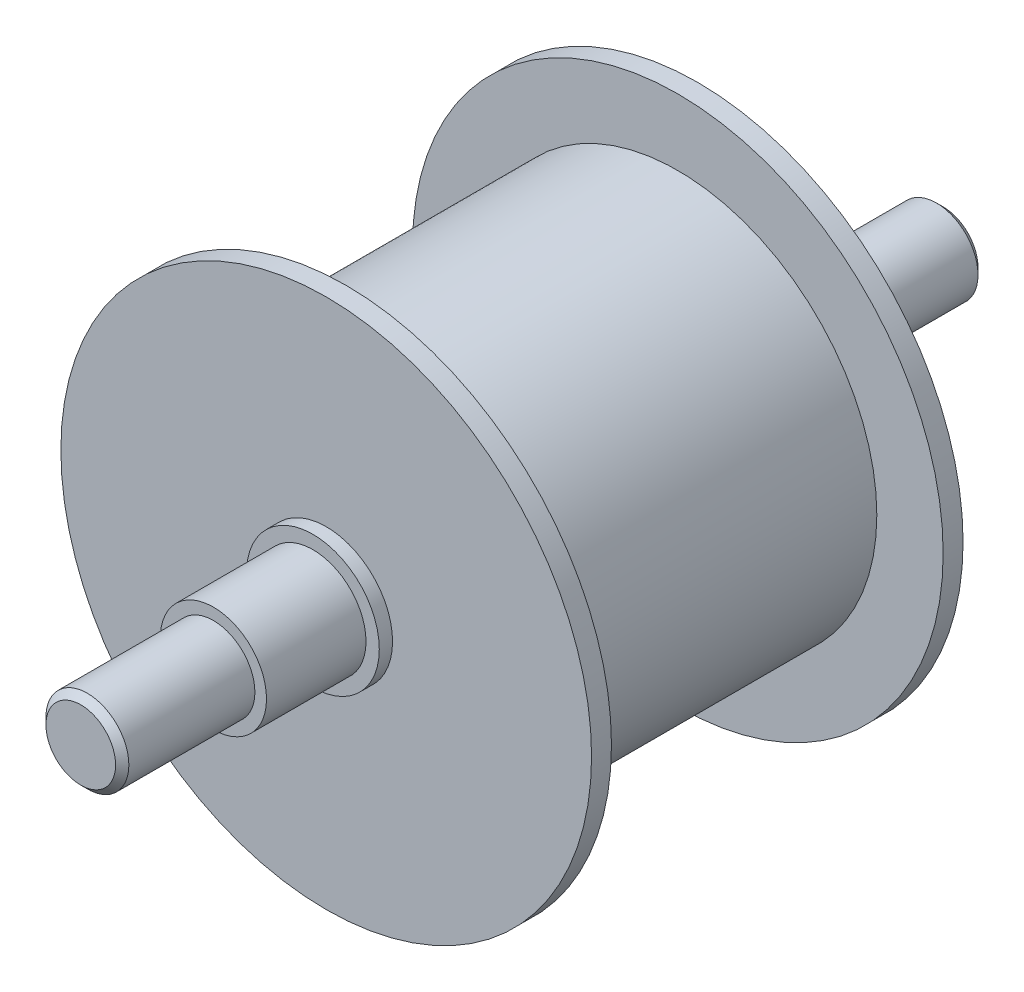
from build123d import *

# Parameters (mm, degrees)
SKIZZE1_R                        = 45
AUFSATZ_LINEAR_AUSTRAGEN1_DEPTH  = 130
SKIZZE2_OUTSIDE_W                = 128.386
SKIZZE2_OUTSIDE_H                = 128.386
SKIZZE2_OUTSIDE_R                = 6.25
SCHNITT_LINEAR_AUSTRAGEN3_DEPTH  = 20
SKIZZE4_OUTSIDE_W                = 128.386
SKIZZE4_OUTSIDE_H                = 128.386
SKIZZE4_OUTSIDE_R                = 8
SCHNITT_LINEAR_AUSTRAGEN4_DEPTH  = 15
SKIZZE5_OUTSIDE_W                = 128.386
SKIZZE5_OUTSIDE_H                = 128.386
SKIZZE5_OUTSIDE_R                = 10
SCHNITT_LINEAR_AUSTRAGEN5_DEPTH  = 2
SKIZZE6_OUTSIDE_W                = 128.386
SKIZZE6_OUTSIDE_H                = 128.386
SKIZZE6_OUTSIDE_R                = 40
SCHNITT_LINEAR_AUSTRAGEN6_DEPTH  = 3
SKIZZE7_OUTSIDE_W                = 128.386
SKIZZE7_OUTSIDE_H                = 128.386
SKIZZE7_OUTSIDE_R                = 30
SCHNITT_LINEAR_AUSTRAGEN7_DEPTH  = 50
SKIZZE8_OUTSIDE_W                = 128.386
SKIZZE8_OUTSIDE_H                = 128.386
SKIZZE8_OUTSIDE_R                = 40
SCHNITT_LINEAR_AUSTRAGEN8_DEPTH  = 3
SKIZZE9_OUTSIDE_W                = 128.386
SKIZZE9_OUTSIDE_H                = 128.386
SKIZZE9_OUTSIDE_R                = 10
SCHNITT_LINEAR_AUSTRAGEN9_DEPTH  = 2
SKIZZE10_OUTSIDE_W               = 128.386
SKIZZE10_OUTSIDE_H               = 128.386
SKIZZE10_OUTSIDE_R               = 8
SCHNITT_LINEAR_AUSTRAGEN10_DEPTH = 15
SKIZZE11_OUTSIDE_W               = 128.386
SKIZZE11_OUTSIDE_H               = 128.386
SKIZZE11_OUTSIDE_R               = 6.25
SCHNITT_LINEAR_AUSTRAGEN11_DEPTH = 20
FASE1_SIZE                       = 1
FASE2_SIZE                       = 1


with BuildPart() as part:
    # Skizze1 → Aufsatz-Linear austragen1 (new body)
    with BuildSketch(Plane.XY):
        Circle(SKIZZE1_R)
    extrude(amount=AUFSATZ_LINEAR_AUSTRAGEN1_DEPTH)

    # Skizze2 outside → Schnitt-Linear austragen3 (cut)
    with BuildSketch(Plane.XY.offset(130)):
        Rectangle(SKIZZE2_OUTSIDE_W, SKIZZE2_OUTSIDE_H)
        Circle(SKIZZE2_OUTSIDE_R, mode=Mode.SUBTRACT)
    extrude(amount=-SCHNITT_LINEAR_AUSTRAGEN3_DEPTH, mode=Mode.SUBTRACT)

    # Skizze4 outside → Schnitt-Linear austragen4 (cut)
    with BuildSketch(Plane.XY.offset(110)):
        Rectangle(SKIZZE4_OUTSIDE_W, SKIZZE4_OUTSIDE_H)
        Circle(SKIZZE4_OUTSIDE_R, mode=Mode.SUBTRACT)
    extrude(amount=-SCHNITT_LINEAR_AUSTRAGEN4_DEPTH, mode=Mode.SUBTRACT)

    # Skizze5 outside → Schnitt-Linear austragen5 (cut)
    with BuildSketch(Plane.XY.offset(95)):
        Rectangle(SKIZZE5_OUTSIDE_W, SKIZZE5_OUTSIDE_H)
        Circle(SKIZZE5_OUTSIDE_R, mode=Mode.SUBTRACT)
    extrude(amount=-SCHNITT_LINEAR_AUSTRAGEN5_DEPTH, mode=Mode.SUBTRACT)

    # Skizze6 outside → Schnitt-Linear austragen6 (cut)
    with BuildSketch(Plane.XY.offset(93)):
        Rectangle(SKIZZE6_OUTSIDE_W, SKIZZE6_OUTSIDE_H)
        Circle(SKIZZE6_OUTSIDE_R, mode=Mode.SUBTRACT)
    extrude(amount=-SCHNITT_LINEAR_AUSTRAGEN6_DEPTH, mode=Mode.SUBTRACT)

    # Skizze7 outside → Schnitt-Linear austragen7 (cut)
    with BuildSketch(Plane.XY.offset(90)):
        Rectangle(SKIZZE7_OUTSIDE_W, SKIZZE7_OUTSIDE_H)
        Circle(SKIZZE7_OUTSIDE_R, mode=Mode.SUBTRACT)
    extrude(amount=-SCHNITT_LINEAR_AUSTRAGEN7_DEPTH, mode=Mode.SUBTRACT)

    # Skizze8 outside → Schnitt-Linear austragen8 (cut)
    with BuildSketch(Plane.XY.offset(40)):
        Rectangle(SKIZZE8_OUTSIDE_W, SKIZZE8_OUTSIDE_H)
        Circle(SKIZZE8_OUTSIDE_R, mode=Mode.SUBTRACT)
    extrude(amount=-SCHNITT_LINEAR_AUSTRAGEN8_DEPTH, mode=Mode.SUBTRACT)

    # Skizze9 outside → Schnitt-Linear austragen9 (cut)
    with BuildSketch(Plane.XY.offset(37)):
        Rectangle(SKIZZE9_OUTSIDE_W, SKIZZE9_OUTSIDE_H)
        Circle(SKIZZE9_OUTSIDE_R, mode=Mode.SUBTRACT)
    extrude(amount=-SCHNITT_LINEAR_AUSTRAGEN9_DEPTH, mode=Mode.SUBTRACT)

    # Skizze10 outside → Schnitt-Linear austragen10 (cut)
    with BuildSketch(Plane.XY.offset(35)):
        Rectangle(SKIZZE10_OUTSIDE_W, SKIZZE10_OUTSIDE_H)
        Circle(SKIZZE10_OUTSIDE_R, mode=Mode.SUBTRACT)
    extrude(amount=-SCHNITT_LINEAR_AUSTRAGEN10_DEPTH, mode=Mode.SUBTRACT)

    # Skizze11 outside → Schnitt-Linear austragen11 (cut)
    with BuildSketch(Plane.XY.offset(20)):
        Rectangle(SKIZZE11_OUTSIDE_W, SKIZZE11_OUTSIDE_H)
        Circle(SKIZZE11_OUTSIDE_R, mode=Mode.SUBTRACT)
    extrude(amount=-SCHNITT_LINEAR_AUSTRAGEN11_DEPTH, mode=Mode.SUBTRACT)

    # Fase1
    fase1_edges = [part.edges().sort_by_distance(p)[0] for p in [
        (-6.25, 0, 130),
    ]]
    chamfer(fase1_edges, length=FASE1_SIZE)

    # Fase2
    fase2_edges = [part.edges().sort_by_distance(p)[0] for p in [
        (-6.25, 0, 0),
    ]]
    chamfer(fase2_edges, length=FASE2_SIZE)


solid = part.part
